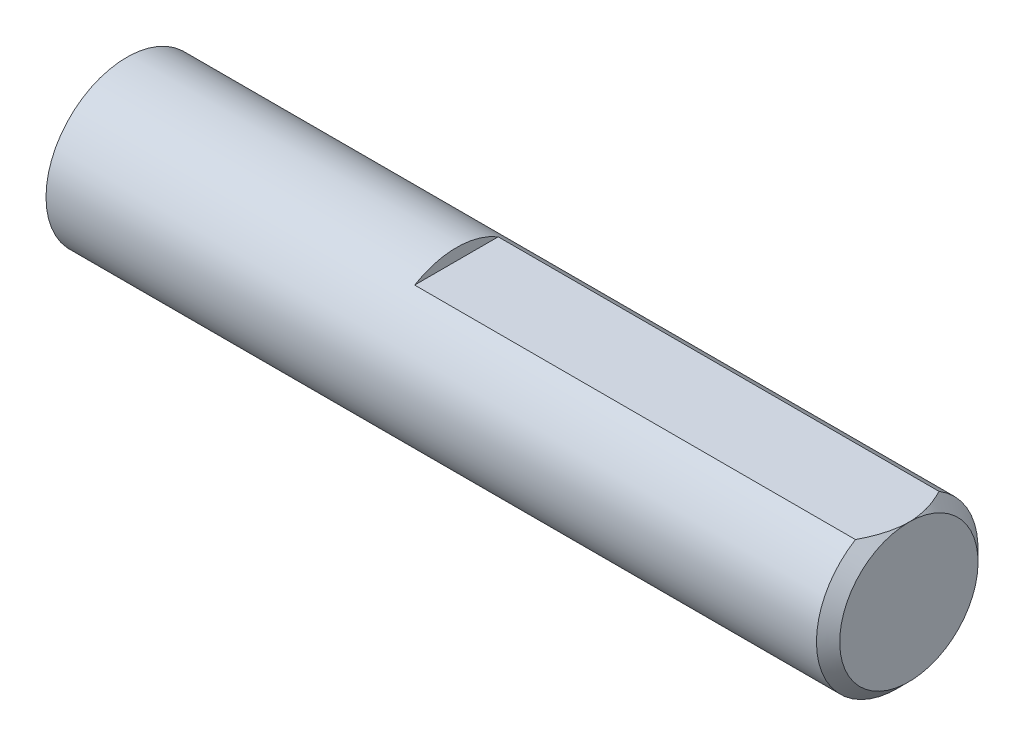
ISO-10303-21;
HEADER;
FILE_DESCRIPTION(('STEP AP214'),'2;1');
FILE_NAME('part.step','',(''),(''),'','','');
FILE_SCHEMA(('AUTOMOTIVE_DESIGN { 1 0 10303 214 1 1 1 1 }'));
ENDSEC;
DATA;
#1=APPLICATION_CONTEXT('core data for automotive mechanical design processes');
#2=APPLICATION_PROTOCOL_DEFINITION('international standard','automotive_design',2000,#1);
#3=PRODUCT_CONTEXT('',#1,'mechanical');
#4=PRODUCT('Part','Part','',(#3));
#5=PRODUCT_RELATED_PRODUCT_CATEGORY('part','',(#4));
#6=PRODUCT_DEFINITION_FORMATION('','',#4);
#7=PRODUCT_DEFINITION_CONTEXT('part definition',#1,'design');
#8=PRODUCT_DEFINITION('design','',#6,#7);
#9=PRODUCT_DEFINITION_SHAPE('','',#8);
#10=(LENGTH_UNIT() NAMED_UNIT(*) SI_UNIT(.MILLI.,.METRE.));
#11=(NAMED_UNIT(*) PLANE_ANGLE_UNIT() SI_UNIT($,.RADIAN.));
#12=(NAMED_UNIT(*) SI_UNIT($,.STERADIAN.) SOLID_ANGLE_UNIT());
#13=UNCERTAINTY_MEASURE_WITH_UNIT(LENGTH_MEASURE(1.E-05),#10,'distance_accuracy_value','');
#14=(GEOMETRIC_REPRESENTATION_CONTEXT(3) GLOBAL_UNCERTAINTY_ASSIGNED_CONTEXT((#13)) GLOBAL_UNIT_ASSIGNED_CONTEXT((#10,
#11,#12)) REPRESENTATION_CONTEXT('',''));
#15=CARTESIAN_POINT('',(0.,0.,0.));
#16=DIRECTION('',(0.,0.,1.));
#17=DIRECTION('',(1.,0.,0.));
#18=AXIS2_PLACEMENT_3D('',#15,#16,#17);
#19=CARTESIAN_POINT('',(-7.62,0.,0.));
#20=DIRECTION('',(1.,0.,0.));
#21=DIRECTION('',(0.,0.,-1.));
#22=AXIS2_PLACEMENT_3D('',#19,#20,#21);
#23=PLANE('',#22);
#24=CARTESIAN_POINT('',(-7.62,0.,0.));
#25=DIRECTION('',(-1.,0.,0.));
#26=DIRECTION('',(0.,0.,1.));
#27=AXIS2_PLACEMENT_3D('',#24,#25,#26);
#28=CIRCLE('',#27,3.175);
#29=CARTESIAN_POINT('',(-7.62,0.,3.175));
#30=VERTEX_POINT('',#29);
#31=EDGE_CURVE('E61',#30,#30,#28,.T.);
#32=ORIENTED_EDGE('',*,*,#31,.T.);
#33=EDGE_LOOP('',(#32));
#34=FACE_BOUND('',#33,.T.);
#35=ADVANCED_FACE('F17',(#34),#23,.F.);
#36=CARTESIAN_POINT('',(-7.62,0.,0.));
#37=DIRECTION('',(-1.,0.,0.));
#38=DIRECTION('',(0.,0.,1.));
#39=AXIS2_PLACEMENT_3D('',#36,#37,#38);
#40=CYLINDRICAL_SURFACE('',#39,3.175);
#41=CARTESIAN_POINT('',(22.6568,0.,0.));
#42=DIRECTION('',(-1.,0.,0.));
#43=DIRECTION('',(0.,0.,1.));
#44=AXIS2_PLACEMENT_3D('',#41,#42,#43);
#45=CIRCLE('',#44,3.175);
#46=CARTESIAN_POINT('',(22.6568,2.7178,-1.6413982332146));
#47=VERTEX_POINT('',#46);
#48=CARTESIAN_POINT('',(22.6568,2.7178,1.6413982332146));
#49=VERTEX_POINT('',#48);
#50=EDGE_CURVE('E60',#47,#49,#45,.T.);
#51=ORIENTED_EDGE('',*,*,#50,.T.);
#52=DIRECTION('',(-1.,0.,0.));
#53=VECTOR('',#52,1.);
#54=CARTESIAN_POINT('',(-7.62,2.7178,1.6413982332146));
#55=LINE('',#54,#53);
#56=CARTESIAN_POINT('',(5.334,2.7178,1.6413982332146));
#57=VERTEX_POINT('',#56);
#58=EDGE_CURVE('E37',#49,#57,#55,.T.);
#59=ORIENTED_EDGE('',*,*,#58,.T.);
#60=CARTESIAN_POINT('',(5.334,0.,0.));
#61=DIRECTION('',(-1.,0.,0.));
#62=DIRECTION('',(0.,0.,1.));
#63=AXIS2_PLACEMENT_3D('',#60,#61,#62);
#64=CIRCLE('',#63,3.175);
#65=CARTESIAN_POINT('',(5.334,2.7178,-1.6413982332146));
#66=VERTEX_POINT('',#65);
#67=EDGE_CURVE('E11',#57,#66,#64,.T.);
#68=ORIENTED_EDGE('',*,*,#67,.T.);
#69=DIRECTION('',(-1.,0.,0.));
#70=VECTOR('',#69,1.);
#71=CARTESIAN_POINT('',(-7.62,2.7178,-1.6413982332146));
#72=LINE('',#71,#70);
#73=EDGE_CURVE('E46',#66,#47,#72,.F.);
#74=ORIENTED_EDGE('',*,*,#73,.T.);
#75=EDGE_LOOP('',(#51,#59,#68,#74));
#76=FACE_BOUND('',#75,.T.);
#77=ORIENTED_EDGE('',*,*,#31,.F.);
#78=EDGE_LOOP('',(#77));
#79=FACE_BOUND('',#78,.T.);
#80=ADVANCED_FACE('F58',(#76,#79),#40,.T.);
#81=CARTESIAN_POINT('',(23.114,0.,0.));
#82=DIRECTION('',(-1.,0.,0.));
#83=DIRECTION('',(0.,0.,1.));
#84=AXIS2_PLACEMENT_3D('',#81,#82,#83);
#85=PLANE('',#84);
#86=CARTESIAN_POINT('',(23.114,0.,0.));
#87=DIRECTION('',(-1.,0.,0.));
#88=DIRECTION('',(0.,0.,1.));
#89=AXIS2_PLACEMENT_3D('',#86,#87,#88);
#90=CIRCLE('',#89,2.7178);
#91=CARTESIAN_POINT('',(23.114,2.7178,0.));
#92=VERTEX_POINT('',#91);
#93=EDGE_CURVE('E67',#92,#92,#90,.F.);
#94=ORIENTED_EDGE('',*,*,#93,.T.);
#95=EDGE_LOOP('',(#94));
#96=FACE_BOUND('',#95,.T.);
#97=ADVANCED_FACE('F79',(#96),#85,.F.);
#98=CARTESIAN_POINT('',(22.6568,0.,0.));
#99=DIRECTION('',(-1.,0.,0.));
#100=DIRECTION('',(0.,0.,1.));
#101=AXIS2_PLACEMENT_3D('',#98,#99,#100);
#102=CONICAL_SURFACE('',#101,3.175,0.785398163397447);
#103=CARTESIAN_POINT('',(19.9259436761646,2.7178,-5.24334836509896));
#104=CARTESIAN_POINT('',(20.0339769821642,2.7178,-5.12164533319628));
#105=CARTESIAN_POINT('',(20.1415851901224,2.7178,-4.99956123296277));
#106=CARTESIAN_POINT('',(20.3557237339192,2.7178,-4.75442815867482));
#107=CARTESIAN_POINT('',(20.462253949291,2.7178,-4.63137907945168));
#108=CARTESIAN_POINT('',(20.6744642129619,2.7178,-4.38358036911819));
#109=CARTESIAN_POINT('',(20.7801382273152,2.7178,-4.2588255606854));
#110=CARTESIAN_POINT('',(20.9897938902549,2.7178,-4.00790999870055));
#111=CARTESIAN_POINT('',(21.0937756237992,2.7178,-3.88174931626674));
#112=CARTESIAN_POINT('',(21.3058896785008,2.7178,-3.61990120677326));
#113=CARTESIAN_POINT('',(21.4138862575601,2.7178,-3.48410347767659));
#114=CARTESIAN_POINT('',(21.626664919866,2.7178,-3.2100151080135));
#115=CARTESIAN_POINT('',(21.7314472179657,2.7178,-3.07172463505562));
#116=CARTESIAN_POINT('',(21.936459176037,2.7178,-2.79217925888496));
#117=CARTESIAN_POINT('',(22.0366967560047,2.7178,-2.65093019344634));
#118=CARTESIAN_POINT('',(22.2310651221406,2.7178,-2.36431398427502));
#119=CARTESIAN_POINT('',(22.3251982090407,2.7178,-2.2189484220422));
#120=CARTESIAN_POINT('',(22.476768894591,2.7178,-1.96884633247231));
#121=CARTESIAN_POINT('',(22.5365206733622,2.7178,-1.86551919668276));
#122=CARTESIAN_POINT('',(22.6505441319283,2.7178,-1.65581021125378));
#123=CARTESIAN_POINT('',(22.7048141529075,2.7178,-1.54942744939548));
#124=CARTESIAN_POINT('',(22.8056631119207,2.7178,-1.33417667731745));
#125=CARTESIAN_POINT('',(22.8523054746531,2.7178,-1.22533874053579));
#126=CARTESIAN_POINT('',(22.9362481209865,2.7178,-1.00410579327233));
#127=CARTESIAN_POINT('',(22.9735541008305,2.7178,-0.891712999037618));
#128=CARTESIAN_POINT('',(23.0266504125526,2.7178,-0.69870745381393));
#129=CARTESIAN_POINT('',(23.0455294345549,2.7178,-0.618946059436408));
#130=CARTESIAN_POINT('',(23.0767814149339,2.7178,-0.45815100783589));
#131=CARTESIAN_POINT('',(23.0891555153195,2.7178,-0.377117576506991));
#132=CARTESIAN_POINT('',(23.1067395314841,2.7178,-0.214532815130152));
#133=CARTESIAN_POINT('',(23.111972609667,2.7178,-0.132984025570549));
#134=CARTESIAN_POINT('',(23.1150567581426,2.7178,0.0302568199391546));
#135=CARTESIAN_POINT('',(23.1129077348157,2.7178,0.111948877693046));
#136=CARTESIAN_POINT('',(23.1013821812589,2.7178,0.274358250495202));
#137=CARTESIAN_POINT('',(23.0920457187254,2.7178,0.35507845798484));
#138=CARTESIAN_POINT('',(23.0666842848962,2.7178,0.515465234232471));
#139=CARTESIAN_POINT('',(23.0506577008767,2.7178,0.595131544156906));
#140=CARTESIAN_POINT('',(23.0124425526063,2.7178,0.753886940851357));
#141=CARTESIAN_POINT('',(22.9901878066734,2.7178,0.832959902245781));
#142=CARTESIAN_POINT('',(22.9404570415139,2.7178,0.989408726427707));
#143=CARTESIAN_POINT('',(22.9129820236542,2.7178,1.06678491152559));
#144=CARTESIAN_POINT('',(22.8427531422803,2.7178,1.24790605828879));
#145=CARTESIAN_POINT('',(22.7980922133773,2.7178,1.35090858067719));
#146=CARTESIAN_POINT('',(22.7024029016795,2.7178,1.55393469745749));
#147=CARTESIAN_POINT('',(22.651370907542,2.7178,1.6539565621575));
#148=CARTESIAN_POINT('',(22.5442073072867,2.7178,1.85169010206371));
#149=CARTESIAN_POINT('',(22.4880574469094,2.7178,1.94939180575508));
#150=CARTESIAN_POINT('',(22.3719420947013,2.7178,2.14245763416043));
#151=CARTESIAN_POINT('',(22.311977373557,2.7178,2.23782222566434));
#152=CARTESIAN_POINT('',(22.1921593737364,2.7178,2.42181082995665));
#153=CARTESIAN_POINT('',(22.1324540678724,2.7178,2.51053170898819));
#154=CARTESIAN_POINT('',(22.010865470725,2.7178,2.68647424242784));
#155=CARTESIAN_POINT('',(21.948982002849,2.7178,2.77369577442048));
#156=CARTESIAN_POINT('',(21.8240150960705,2.7178,2.94608279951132));
#157=CARTESIAN_POINT('',(21.7609473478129,2.7178,3.03125970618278));
#158=CARTESIAN_POINT('',(21.6333910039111,2.7178,3.20050897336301));
#159=CARTESIAN_POINT('',(21.5689027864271,2.7178,3.28458161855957));
#160=CARTESIAN_POINT('',(21.5038422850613,2.7178,3.36820146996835));
#161=B_SPLINE_CURVE_WITH_KNOTS('',3,(#103,#104,#105,#106,#107,#108,#109,#110,#111,#112,#113,
#114,#115,#116,#117,#118,#119,#120,#121,#122,#123,#124,#125,#126,#127,#128,#129,#130,#131,#132,
#133,#134,#135,#136,#137,#138,#139,#140,#141,#142,#143,#144,#145,#146,#147,#148,#149,#150,#151,
#152,#153,#154,#155,#156,#157,#158,#159,#160),.UNSPECIFIED.,.F.,.F.,(4,2,2,2,2,2,2,2,2,2,2,2,2,
2,2,2,2,2,2,2,2,2,2,2,2,2,2,2,4),(0.,0.488209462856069,0.976472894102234,1.46694724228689,
1.95739689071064,2.47787924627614,2.9983267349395,3.51782934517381,4.03713500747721,
4.39509195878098,4.7531569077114,5.10807376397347,5.46277355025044,5.70843851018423,
5.95406032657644,6.19888354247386,6.44370986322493,6.68718115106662,6.93071116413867,
7.17693422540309,7.42311010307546,7.75961682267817,8.09631515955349,8.43426529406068,
8.77214737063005,9.09292804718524,9.41373479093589,9.73167116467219,10.0495238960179),.UNSPECIFIED.);
#162=EDGE_CURVE('E26',#49,#92,#161,.F.);
#163=ORIENTED_EDGE('',*,*,#162,.F.);
#164=ORIENTED_EDGE('',*,*,#50,.F.);
#165=EDGE_CURVE('E50',#92,#47,#161,.F.);
#166=ORIENTED_EDGE('',*,*,#165,.F.);
#167=ORIENTED_EDGE('',*,*,#93,.F.);
#168=EDGE_LOOP('',(#163,#164,#166,#167));
#169=FACE_BOUND('',#168,.T.);
#170=ADVANCED_FACE('F19',(#169),#102,.T.);
#171=CARTESIAN_POINT('',(5.334,3.175,-3.175));
#172=DIRECTION('',(-1.,0.,0.));
#173=DIRECTION('',(0.,0.,1.));
#174=AXIS2_PLACEMENT_3D('',#171,#172,#173);
#175=PLANE('',#174);
#176=DIRECTION('',(0.,0.,1.));
#177=VECTOR('',#176,1.);
#178=CARTESIAN_POINT('',(5.334,2.7178,-3.175));
#179=LINE('',#178,#177);
#180=EDGE_CURVE('E49',#66,#57,#179,.T.);
#181=ORIENTED_EDGE('',*,*,#180,.F.);
#182=ORIENTED_EDGE('',*,*,#67,.F.);
#183=EDGE_LOOP('',(#181,#182));
#184=FACE_BOUND('',#183,.T.);
#185=ADVANCED_FACE('F56',(#184),#175,.F.);
#186=CARTESIAN_POINT('',(5.334,2.7178,-3.175));
#187=DIRECTION('',(0.,-1.,0.));
#188=DIRECTION('',(1.,0.,0.));
#189=AXIS2_PLACEMENT_3D('',#186,#187,#188);
#190=PLANE('',#189);
#191=ORIENTED_EDGE('',*,*,#162,.T.);
#192=ORIENTED_EDGE('',*,*,#165,.T.);
#193=ORIENTED_EDGE('',*,*,#73,.F.);
#194=ORIENTED_EDGE('',*,*,#180,.T.);
#195=ORIENTED_EDGE('',*,*,#58,.F.);
#196=EDGE_LOOP('',(#191,#192,#193,#194,#195));
#197=FACE_BOUND('',#196,.T.);
#198=ADVANCED_FACE('F48',(#197),#190,.F.);
#199=CLOSED_SHELL('',(#35,#80,#97,#170,#185,#198));
#200=MANIFOLD_SOLID_BREP('B1',#199);
#201=ADVANCED_BREP_SHAPE_REPRESENTATION('',(#18,#200),#14);
#202=SHAPE_DEFINITION_REPRESENTATION(#9,#201);
ENDSEC;
END-ISO-10303-21;
